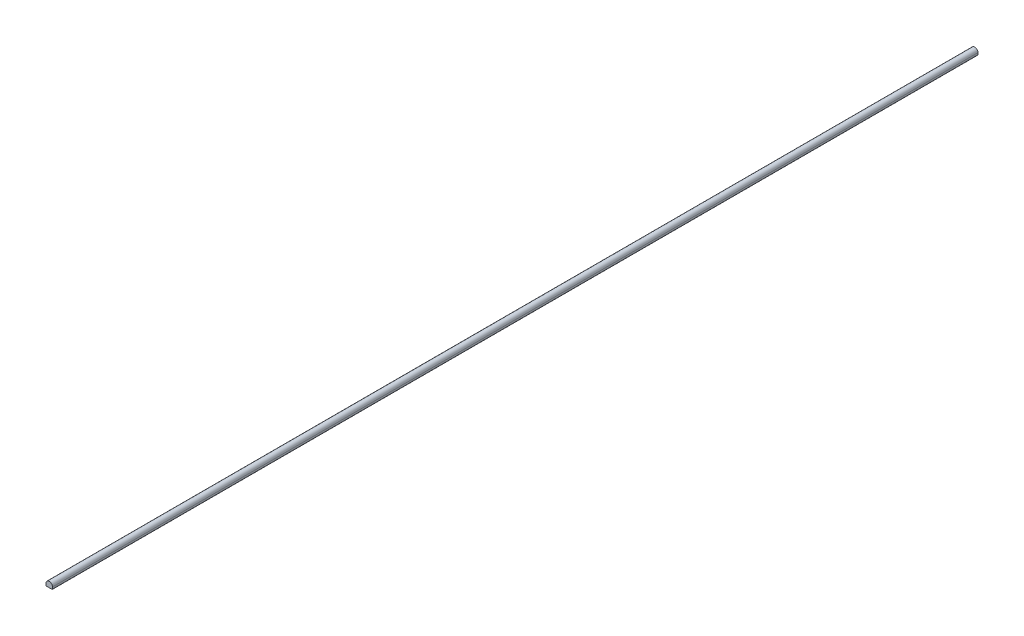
from build123d import *

# Parameters (mm, degrees)
EXTRUDE_1_DEPTH = 2000
FILLET_1_R      = 1


with BuildPart() as part:
    # Sketch 1 → Extrude 1 (new body)
    with BuildSketch(Plane.XY):
        with BuildLine():
            Line((0, 0), (0, 5))
            ThreePointArc((0, 5), (7, 12), (14, 5))
            Line((14, 5), (14, 0))
            Line((14, 0), (0, 0))
        make_face()
    extrude(amount=EXTRUDE_1_DEPTH)

    # Fillet 1
    fillet_1_edges = [part.edges().sort_by_distance(p)[0] for p in [
        (14, 0, 1000),
        (0, 0, 1000),
    ]]
    fillet(fillet_1_edges, radius=FILLET_1_R)


solid = part.part
